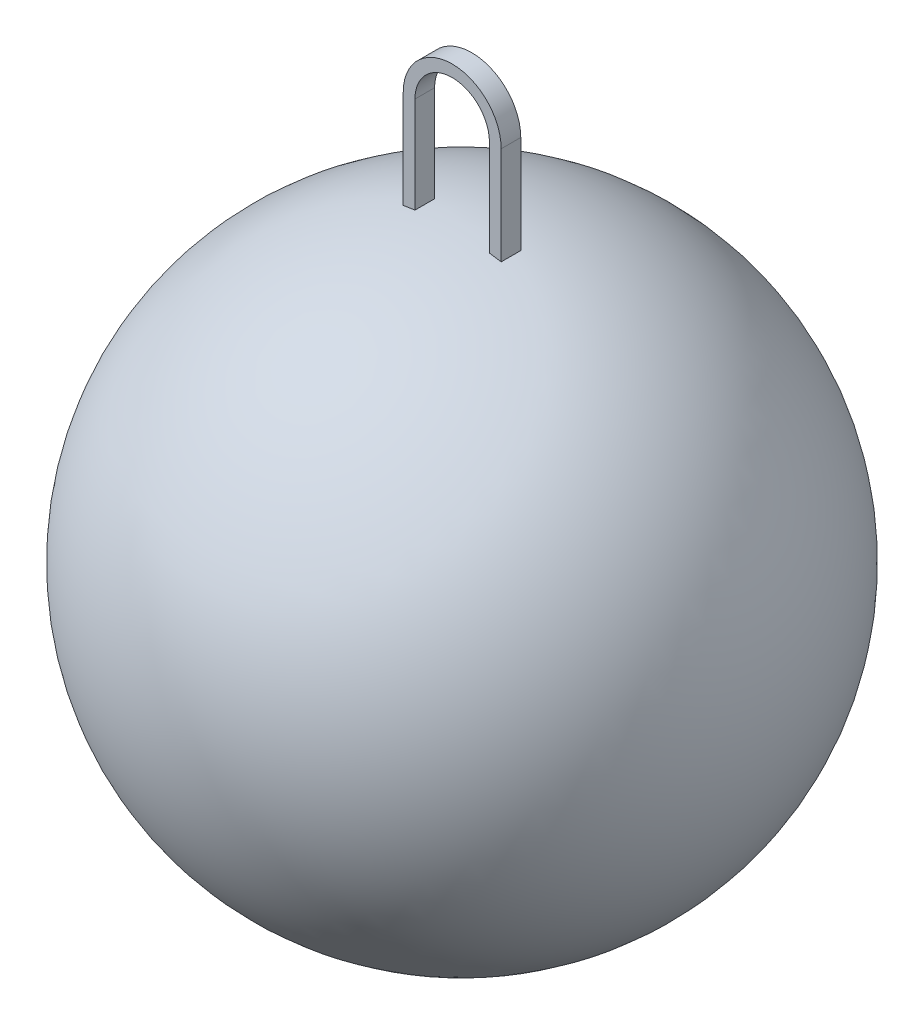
ISO-10303-21;
HEADER;
FILE_DESCRIPTION(('STEP AP214'),'2;1');
FILE_NAME('part.step','',(''),(''),'','','');
FILE_SCHEMA(('AUTOMOTIVE_DESIGN { 1 0 10303 214 1 1 1 1 }'));
ENDSEC;
DATA;
#1=APPLICATION_CONTEXT('core data for automotive mechanical design processes');
#2=APPLICATION_PROTOCOL_DEFINITION('international standard','automotive_design',2000,#1);
#3=PRODUCT_CONTEXT('',#1,'mechanical');
#4=PRODUCT('Part','Part','',(#3));
#5=PRODUCT_RELATED_PRODUCT_CATEGORY('part','',(#4));
#6=PRODUCT_DEFINITION_FORMATION('','',#4);
#7=PRODUCT_DEFINITION_CONTEXT('part definition',#1,'design');
#8=PRODUCT_DEFINITION('design','',#6,#7);
#9=PRODUCT_DEFINITION_SHAPE('','',#8);
#10=(LENGTH_UNIT() NAMED_UNIT(*) SI_UNIT(.MILLI.,.METRE.));
#11=(NAMED_UNIT(*) PLANE_ANGLE_UNIT() SI_UNIT($,.RADIAN.));
#12=(NAMED_UNIT(*) SI_UNIT($,.STERADIAN.) SOLID_ANGLE_UNIT());
#13=UNCERTAINTY_MEASURE_WITH_UNIT(LENGTH_MEASURE(1.E-05),#10,'distance_accuracy_value','');
#14=(GEOMETRIC_REPRESENTATION_CONTEXT(3) GLOBAL_UNCERTAINTY_ASSIGNED_CONTEXT((#13)) GLOBAL_UNIT_ASSIGNED_CONTEXT((#10,
#11,#12)) REPRESENTATION_CONTEXT('',''));
#15=CARTESIAN_POINT('',(0.,0.,0.));
#16=DIRECTION('',(0.,0.,1.));
#17=DIRECTION('',(1.,0.,0.));
#18=AXIS2_PLACEMENT_3D('',#15,#16,#17);
#19=CARTESIAN_POINT('',(-3.175,18.7835533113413,0.635));
#20=CARTESIAN_POINT('',(-2.92133611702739,18.8230332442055,0.635));
#21=CARTESIAN_POINT('',(-2.66767223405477,18.8625131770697,0.635));
#22=CARTESIAN_POINT('',(-2.413,18.8965587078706,0.635));
#23=B_SPLINE_CURVE_WITH_KNOTS('',3,(#19,#20,#21,#22),.UNSPECIFIED.,.F.,.F.,(4,4),(0.,
0.120994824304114),.UNSPECIFIED.);
#24=DIRECTION('',(0.,0.,-1.));
#25=VECTOR('',#24,1.);
#26=SURFACE_OF_LINEAR_EXTRUSION('',#23,#25);
#27=CARTESIAN_POINT('',(-2.41300000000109,18.8965587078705,0.));
#28=CARTESIAN_POINT('',(-2.41300225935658,18.8965584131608,0.00758621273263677));
#29=CARTESIAN_POINT('',(-2.41377594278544,18.8964550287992,0.015180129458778));
#30=CARTESIAN_POINT('',(-2.41674835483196,18.8960572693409,0.0300880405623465));
#31=CARTESIAN_POINT('',(-2.41895191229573,18.8957622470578,0.0374009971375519));
#32=CARTESIAN_POINT('',(-2.4252752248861,18.8949137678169,0.0535623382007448));
#33=CARTESIAN_POINT('',(-2.42976016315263,18.8943108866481,0.0622619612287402));
#34=CARTESIAN_POINT('',(-2.44000444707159,18.8929287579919,0.0788503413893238));
#35=CARTESIAN_POINT('',(-2.44576673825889,18.8921491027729,0.0867371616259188));
#36=CARTESIAN_POINT('',(-2.46336550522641,18.8897580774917,0.108142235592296));
#37=CARTESIAN_POINT('',(-2.47622273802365,18.8880002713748,0.120792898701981));
#38=CARTESIAN_POINT('',(-2.50349402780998,18.8842406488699,0.144229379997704));
#39=CARTESIAN_POINT('',(-2.51791298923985,18.8822380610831,0.155009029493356));
#40=CARTESIAN_POINT('',(-2.54704810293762,18.8781586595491,0.174550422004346));
#41=CARTESIAN_POINT('',(-2.56171771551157,18.8760898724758,0.183383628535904));
#42=CARTESIAN_POINT('',(-2.59172813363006,18.8718263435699,0.199783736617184));
#43=CARTESIAN_POINT('',(-2.60706925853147,18.8696315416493,0.207350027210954));
#44=CARTESIAN_POINT('',(-2.6539001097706,18.8628845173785,0.228226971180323));
#45=CARTESIAN_POINT('',(-2.68620541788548,18.8581685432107,0.239720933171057));
#46=CARTESIAN_POINT('',(-2.74672473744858,18.8492270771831,0.255876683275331));
#47=CARTESIAN_POINT('',(-2.7747312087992,18.8450495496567,0.261354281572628));
#48=CARTESIAN_POINT('',(-2.83128094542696,18.8365454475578,0.267820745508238));
#49=CARTESIAN_POINT('',(-2.85982372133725,18.8322190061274,0.268813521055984));
#50=CARTESIAN_POINT('',(-2.90785295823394,18.8248941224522,0.265801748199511));
#51=CARTESIAN_POINT('',(-2.92742813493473,18.8218959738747,0.263238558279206));
#52=CARTESIAN_POINT('',(-2.96592898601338,18.815980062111,0.255056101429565));
#53=CARTESIAN_POINT('',(-2.98485607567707,18.8130621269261,0.249444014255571));
#54=CARTESIAN_POINT('',(-3.01817095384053,18.807914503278,0.236144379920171));
#55=CARTESIAN_POINT('',(-3.03276930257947,18.8056543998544,0.228999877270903));
#56=CARTESIAN_POINT('',(-3.06058098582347,18.8013432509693,0.212372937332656));
#57=CARTESIAN_POINT('',(-3.07379708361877,18.7992917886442,0.202895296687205));
#58=CARTESIAN_POINT('',(-3.09843237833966,18.7954650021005,0.181611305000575));
#59=CARTESIAN_POINT('',(-3.10983796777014,18.7936917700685,0.169788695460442));
#60=CARTESIAN_POINT('',(-3.13021750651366,18.7905222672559,0.144158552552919));
#61=CARTESIAN_POINT('',(-3.13919233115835,18.7891258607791,0.130351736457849));
#62=CARTESIAN_POINT('',(-3.15345363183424,18.7869066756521,0.102862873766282));
#63=CARTESIAN_POINT('',(-3.15904072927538,18.7860371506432,0.0893402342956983));
#64=CARTESIAN_POINT('',(-3.16780015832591,18.7846738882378,0.0615120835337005));
#65=CARTESIAN_POINT('',(-3.17096971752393,18.7841805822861,0.0472056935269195));
#66=CARTESIAN_POINT('',(-3.17649005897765,18.7833213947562,0.00496288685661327));
#67=CARTESIAN_POINT('',(-3.17545919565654,18.7834818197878,-0.0235073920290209));
#68=CARTESIAN_POINT('',(-3.16412226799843,18.7852463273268,-0.0783368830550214));
#69=CARTESIAN_POINT('',(-3.15384571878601,18.7868458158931,-0.104702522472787));
#70=CARTESIAN_POINT('',(-3.12529474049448,18.7912881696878,-0.152671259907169));
#71=CARTESIAN_POINT('',(-3.10698395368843,18.7941366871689,-0.174252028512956));
#72=CARTESIAN_POINT('',(-3.06391971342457,18.8008260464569,-0.211398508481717));
#73=CARTESIAN_POINT('',(-3.03893356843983,18.8047026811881,-0.226682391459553));
#74=CARTESIAN_POINT('',(-2.99404481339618,18.8116439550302,-0.246300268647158));
#75=CARTESIAN_POINT('',(-2.974899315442,18.8145981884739,-0.252549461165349));
#76=CARTESIAN_POINT('',(-2.93584093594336,18.8206055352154,-0.261834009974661));
#77=CARTESIAN_POINT('',(-2.91592688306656,18.8236587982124,-0.264864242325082));
#78=CARTESIAN_POINT('',(-2.86794595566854,18.8309842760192,-0.268740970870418));
#79=CARTESIAN_POINT('',(-2.83977621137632,18.8352599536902,-0.268245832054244));
#80=CARTESIAN_POINT('',(-2.78384118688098,18.8436853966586,-0.262795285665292));
#81=CARTESIAN_POINT('',(-2.75607726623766,18.8478347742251,-0.25782734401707));
#82=CARTESIAN_POINT('',(-2.69367668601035,18.8570745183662,-0.242233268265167));
#83=CARTESIAN_POINT('',(-2.6593255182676,18.8620977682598,-0.230401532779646));
#84=CARTESIAN_POINT('',(-2.60966513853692,18.8692597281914,-0.208609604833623));
#85=CARTESIAN_POINT('',(-2.59344898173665,18.8715812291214,-0.200688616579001));
#86=CARTESIAN_POINT('',(-2.56174175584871,18.8760870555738,-0.183430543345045));
#87=CARTESIAN_POINT('',(-2.54625098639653,18.8782713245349,-0.17409287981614));
#88=CARTESIAN_POINT('',(-2.52081739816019,18.8818305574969,-0.156896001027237));
#89=CARTESIAN_POINT('',(-2.51060895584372,18.8832511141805,-0.149438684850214));
#90=CARTESIAN_POINT('',(-2.49088952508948,18.8859807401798,-0.133648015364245));
#91=CARTESIAN_POINT('',(-2.4813775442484,18.8872899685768,-0.12531595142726));
#92=CARTESIAN_POINT('',(-2.46323010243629,18.889775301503,-0.107481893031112));
#93=CARTESIAN_POINT('',(-2.45460803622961,18.8909493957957,-0.0979657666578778));
#94=CARTESIAN_POINT('',(-2.43902204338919,18.8930624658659,-0.0776255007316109));
#95=CARTESIAN_POINT('',(-2.43205117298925,18.8940024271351,-0.0668071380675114));
#96=CARTESIAN_POINT('',(-2.42336849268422,18.8951698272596,-0.0489186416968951));
#97=CARTESIAN_POINT('',(-2.42069769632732,18.895528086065,-0.0423283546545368));
#98=CARTESIAN_POINT('',(-2.4164637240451,18.8960954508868,-0.0288041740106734));
#99=CARTESIAN_POINT('',(-2.41489682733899,18.8963050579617,-0.0218715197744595));
#100=CARTESIAN_POINT('',(-2.41332785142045,18.8965148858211,-0.00993238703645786));
#101=CARTESIAN_POINT('',(-2.41299852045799,18.8965589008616,-0.00496784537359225));
#102=CARTESIAN_POINT('',(-2.41300000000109,18.8965587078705,0.));
#103=B_SPLINE_CURVE_WITH_KNOTS('',3,(#27,#28,#29,#30,#31,#32,#33,#34,#35,#36,#37,#38,#39,#40,
#41,#42,#43,#44,#45,#46,#47,#48,#49,#50,#51,#52,#53,#54,#55,#56,#57,#58,#59,#60,#61,#62,#63,#64,
#65,#66,#67,#68,#69,#70,#71,#72,#73,#74,#75,#76,#77,#78,#79,#80,#81,#82,#83,#84,#85,#86,#87,#88,
#89,#90,#91,#92,#93,#94,#95,#96,#97,#98,#99,#100,#101,#102),.UNSPECIFIED.,.T.,.F.,(4,2,2,2,2,2,
2,2,2,2,2,2,2,2,2,2,2,2,2,2,2,2,2,2,2,2,2,2,2,2,2,2,2,2,2,2,2,4),(0.,0.0227360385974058,
0.0455492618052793,0.0747975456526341,0.104113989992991,0.158182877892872,0.212426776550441,
0.264097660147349,0.315793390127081,0.419156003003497,0.505415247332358,0.591599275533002,
0.651310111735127,0.710880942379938,0.759909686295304,0.808838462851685,0.858119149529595,
0.907382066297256,0.951124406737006,0.994916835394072,1.07863906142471,1.16209496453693,
1.24593249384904,1.33319587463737,1.39398836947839,1.45487748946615,1.53990109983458,
1.6251637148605,1.73462195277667,1.78916416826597,1.84372871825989,1.88185735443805,
1.91993055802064,1.95851197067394,1.99692813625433,2.01821322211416,2.0394262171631,
2.05431495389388),.UNSPECIFIED.);
#104=CARTESIAN_POINT('',(-2.413,18.8965587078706,0.));
#105=VERTEX_POINT('',#104);
#106=CARTESIAN_POINT('',(-3.175,18.7835533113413,0.));
#107=VERTEX_POINT('',#106);
#108=EDGE_CURVE('E11',#105,#107,#103,.T.);
#109=ORIENTED_EDGE('',*,*,#108,.F.);
#110=DIRECTION('',(0.,0.,-1.));
#111=VECTOR('',#110,1.);
#112=CARTESIAN_POINT('',(-2.413,18.8965587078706,0.635));
#113=LINE('',#112,#111);
#114=CARTESIAN_POINT('',(-2.413,18.8965587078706,0.635));
#115=VERTEX_POINT('',#114);
#116=EDGE_CURVE('E54',#115,#105,#113,.T.);
#117=ORIENTED_EDGE('',*,*,#116,.F.);
#118=CARTESIAN_POINT('',(-3.175,18.7835533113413,0.635));
#119=VERTEX_POINT('',#118);
#120=EDGE_CURVE('E164',#119,#115,#23,.T.);
#121=ORIENTED_EDGE('',*,*,#120,.F.);
#122=DIRECTION('',(0.,0.,-1.));
#123=VECTOR('',#122,1.);
#124=CARTESIAN_POINT('',(-3.175,18.7835533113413,0.635));
#125=LINE('',#124,#123);
#126=EDGE_CURVE('E214',#119,#107,#125,.T.);
#127=ORIENTED_EDGE('',*,*,#126,.T.);
#128=EDGE_LOOP('',(#109,#117,#121,#127));
#129=FACE_BOUND('',#128,.T.);
#130=ADVANCED_FACE('F36',(#129),#26,.F.);
#131=CARTESIAN_POINT('',(2.413,18.8965587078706,0.635));
#132=CARTESIAN_POINT('',(2.66767223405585,18.8625131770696,0.635));
#133=CARTESIAN_POINT('',(2.92133611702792,18.8230332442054,0.635));
#134=CARTESIAN_POINT('',(3.175,18.7835533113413,0.635));
#135=B_SPLINE_CURVE_WITH_KNOTS('',3,(#131,#132,#133,#134),.UNSPECIFIED.,.F.,.F.,(4,4),
(0.879005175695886,1.),.UNSPECIFIED.);
#136=DIRECTION('',(0.,0.,-1.));
#137=VECTOR('',#136,1.);
#138=SURFACE_OF_LINEAR_EXTRUSION('',#135,#137);
#139=CARTESIAN_POINT('',(3.175,18.7835533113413,0.));
#140=CARTESIAN_POINT('',(3.17500042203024,18.7835532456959,0.0142311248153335));
#141=CARTESIAN_POINT('',(3.17378982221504,18.7837416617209,0.028458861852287));
#142=CARTESIAN_POINT('',(3.16898438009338,18.7844895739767,0.0564954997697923));
#143=CARTESIAN_POINT('',(3.16538986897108,18.7850490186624,0.0703044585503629));
#144=CARTESIAN_POINT('',(3.15592886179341,18.7865214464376,0.0970941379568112));
#145=CARTESIAN_POINT('',(3.15006314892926,18.7874343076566,0.110075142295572));
#146=CARTESIAN_POINT('',(3.13625243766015,18.7895832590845,0.134847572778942));
#147=CARTESIAN_POINT('',(3.12830742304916,18.7908193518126,0.146638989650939));
#148=CARTESIAN_POINT('',(3.11064957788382,18.7935655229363,0.168684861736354));
#149=CARTESIAN_POINT('',(3.100944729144,18.7950743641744,0.178945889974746));
#150=CARTESIAN_POINT('',(3.08005686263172,18.7983196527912,0.197810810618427));
#151=CARTESIAN_POINT('',(3.06887178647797,18.8000564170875,0.206412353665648));
#152=CARTESIAN_POINT('',(3.04456738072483,18.8038262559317,0.22238871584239));
#153=CARTESIAN_POINT('',(3.03136787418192,18.8058715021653,0.229638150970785));
#154=CARTESIAN_POINT('',(3.00406835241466,18.8100947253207,0.24216089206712));
#155=CARTESIAN_POINT('',(2.98996652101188,18.8122729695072,0.24743005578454));
#156=CARTESIAN_POINT('',(2.93273778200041,18.8210929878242,0.264646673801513));
#157=CARTESIAN_POINT('',(2.88736237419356,18.8280428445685,0.26919360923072));
#158=CARTESIAN_POINT('',(2.81053281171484,18.8396785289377,0.266442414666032));
#159=CARTESIAN_POINT('',(2.77880471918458,18.8444439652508,0.262156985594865));
#160=CARTESIAN_POINT('',(2.71637202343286,18.8537274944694,0.248627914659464));
#161=CARTESIAN_POINT('',(2.68566723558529,18.8582456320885,0.23938517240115));
#162=CARTESIAN_POINT('',(2.62477326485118,18.8670999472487,0.216162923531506));
#163=CARTESIAN_POINT('',(2.59464239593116,18.8714237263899,0.20202493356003));
#164=CARTESIAN_POINT('',(2.55145758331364,18.8775378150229,0.177231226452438));
#165=CARTESIAN_POINT('',(2.53739176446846,18.879514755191,0.168363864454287));
#166=CARTESIAN_POINT('',(2.51020225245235,18.883309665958,0.149262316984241));
#167=CARTESIAN_POINT('',(2.49707726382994,18.885127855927,0.139030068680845));
#168=CARTESIAN_POINT('',(2.47301390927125,18.8884389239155,0.117577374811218));
#169=CARTESIAN_POINT('',(2.46199110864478,18.8899448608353,0.106454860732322));
#170=CARTESIAN_POINT('',(2.44217189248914,18.8926374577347,0.0823801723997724));
#171=CARTESIAN_POINT('',(2.43335443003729,18.8938271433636,0.069447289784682));
#172=CARTESIAN_POINT('',(2.42351929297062,18.8951495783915,0.0492488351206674));
#173=CARTESIAN_POINT('',(2.42088333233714,18.8955031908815,0.0427977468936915));
#174=CARTESIAN_POINT('',(2.41666253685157,18.8960688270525,0.0295512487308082));
#175=CARTESIAN_POINT('',(2.41507654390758,18.8962810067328,0.0227562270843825));
#176=CARTESIAN_POINT('',(2.4131410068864,18.8965398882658,0.0089310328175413));
#177=CARTESIAN_POINT('',(2.41280073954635,18.8965853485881,0.00189948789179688));
#178=CARTESIAN_POINT('',(2.41342927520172,18.896501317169,-0.0121033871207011));
#179=CARTESIAN_POINT('',(2.41439869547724,18.8963717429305,-0.0190746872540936));
#180=CARTESIAN_POINT('',(2.41948813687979,18.8956904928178,-0.0413019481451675));
#181=CARTESIAN_POINT('',(2.42603426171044,18.8948133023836,-0.0559884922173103));
#182=CARTESIAN_POINT('',(2.44102392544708,18.8927914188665,-0.0806861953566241));
#183=CARTESIAN_POINT('',(2.448946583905,18.8917188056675,-0.0910669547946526));
#184=CARTESIAN_POINT('',(2.46617585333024,18.8893728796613,-0.110632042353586));
#185=CARTESIAN_POINT('',(2.47548683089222,18.8880989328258,-0.119812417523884));
#186=CARTESIAN_POINT('',(2.49512626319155,18.8853960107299,-0.13725813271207));
#187=CARTESIAN_POINT('',(2.50546727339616,18.8839650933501,-0.145508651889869));
#188=CARTESIAN_POINT('',(2.52678928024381,18.8809971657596,-0.161117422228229));
#189=CARTESIAN_POINT('',(2.53777064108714,18.8794600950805,-0.168475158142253));
#190=CARTESIAN_POINT('',(2.57145794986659,18.8747171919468,-0.189376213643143));
#191=CARTESIAN_POINT('',(2.59488738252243,18.8713823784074,-0.201730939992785));
#192=CARTESIAN_POINT('',(2.64576214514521,18.8640610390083,-0.224780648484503));
#193=CARTESIAN_POINT('',(2.6733602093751,18.8600436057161,-0.235123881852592));
#194=CARTESIAN_POINT('',(2.72968463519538,18.8517566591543,-0.251935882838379));
#195=CARTESIAN_POINT('',(2.7584102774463,18.8474873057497,-0.258407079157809));
#196=CARTESIAN_POINT('',(2.8111958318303,18.8395731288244,-0.265990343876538));
#197=CARTESIAN_POINT('',(2.83514836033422,18.8359568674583,-0.267866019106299));
#198=CARTESIAN_POINT('',(2.88307053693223,18.8286800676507,-0.267948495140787));
#199=CARTESIAN_POINT('',(2.90704013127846,18.8250195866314,-0.26615963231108));
#200=CARTESIAN_POINT('',(2.94880544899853,18.8186141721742,-0.259141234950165));
#201=CARTESIAN_POINT('',(2.96674620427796,18.815853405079,-0.254803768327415));
#202=CARTESIAN_POINT('',(3.00169102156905,18.8104630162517,-0.243262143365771));
#203=CARTESIAN_POINT('',(3.01869698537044,18.8078331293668,-0.236064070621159));
#204=CARTESIAN_POINT('',(3.0484853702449,18.8032191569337,-0.220064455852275));
#205=CARTESIAN_POINT('',(3.06150439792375,18.8011996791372,-0.211715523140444));
#206=CARTESIAN_POINT('',(3.08596924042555,18.7974015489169,-0.192949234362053));
#207=CARTESIAN_POINT('',(3.09741819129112,18.795622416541,-0.182536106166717));
#208=CARTESIAN_POINT('',(3.11837608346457,18.7923641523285,-0.15976089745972));
#209=CARTESIAN_POINT('',(3.12787463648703,18.7908866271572,-0.147388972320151));
#210=CARTESIAN_POINT('',(3.14446511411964,18.7883054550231,-0.121081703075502));
#211=CARTESIAN_POINT('',(3.1515565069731,18.7872018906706,-0.107146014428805));
#212=CARTESIAN_POINT('',(3.16312113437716,18.7854021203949,-0.0779867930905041));
#213=CARTESIAN_POINT('',(3.16755852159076,18.7847114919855,-0.0627486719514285));
#214=CARTESIAN_POINT('',(3.1734998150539,18.783786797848,-0.0316728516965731));
#215=CARTESIAN_POINT('',(3.17499953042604,18.783553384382,-0.0158343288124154));
#216=CARTESIAN_POINT('',(3.175,18.7835533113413,0.));
#217=B_SPLINE_CURVE_WITH_KNOTS('',3,(#139,#140,#141,#142,#143,#144,#145,#146,#147,#148,#149,
#150,#151,#152,#153,#154,#155,#156,#157,#158,#159,#160,#161,#162,#163,#164,#165,#166,#167,#168,
#169,#170,#171,#172,#173,#174,#175,#176,#177,#178,#179,#180,#181,#182,#183,#184,#185,#186,#187,
#188,#189,#190,#191,#192,#193,#194,#195,#196,#197,#198,#199,#200,#201,#202,#203,#204,#205,#206,
#207,#208,#209,#210,#211,#212,#213,#214,#215,#216),.UNSPECIFIED.,.T.,.F.,(4,2,2,2,2,2,2,2,2,2,2,
2,2,2,2,2,2,2,2,2,2,2,2,2,2,2,2,2,2,2,2,2,2,2,2,2,2,2,4),(0.,0.0426352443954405,
0.0852645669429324,0.127879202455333,0.170494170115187,0.212920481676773,0.255406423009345,
0.300820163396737,0.346328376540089,0.481834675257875,0.578631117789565,0.675410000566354,
0.775671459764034,0.825849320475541,0.875956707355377,0.923017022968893,0.969609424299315,
0.990471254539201,1.01131003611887,1.03230368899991,1.05330724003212,1.10063988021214,
1.13982144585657,1.17912895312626,1.21899383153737,1.25888160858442,1.33873391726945,
1.42772459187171,1.51665938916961,1.58933100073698,1.66191666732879,1.7177041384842,
1.77337355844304,1.81996888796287,1.86646974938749,1.91321220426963,1.95996497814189,
2.00733575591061,2.05477406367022),.UNSPECIFIED.);
#218=CARTESIAN_POINT('',(3.175,18.7835533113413,0.));
#219=VERTEX_POINT('',#218);
#220=CARTESIAN_POINT('',(2.413,18.8965587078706,0.));
#221=VERTEX_POINT('',#220);
#222=EDGE_CURVE('E236',#219,#221,#217,.T.);
#223=ORIENTED_EDGE('',*,*,#222,.F.);
#224=DIRECTION('',(0.,0.,-1.));
#225=VECTOR('',#224,1.);
#226=CARTESIAN_POINT('',(3.175,18.7835533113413,0.635));
#227=LINE('',#226,#225);
#228=CARTESIAN_POINT('',(3.175,18.7835533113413,0.635));
#229=VERTEX_POINT('',#228);
#230=EDGE_CURVE('E62',#229,#219,#227,.T.);
#231=ORIENTED_EDGE('',*,*,#230,.F.);
#232=CARTESIAN_POINT('',(2.413,18.8965587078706,0.635));
#233=VERTEX_POINT('',#232);
#234=EDGE_CURVE('E197',#233,#229,#135,.T.);
#235=ORIENTED_EDGE('',*,*,#234,.F.);
#236=DIRECTION('',(0.,0.,-1.));
#237=VECTOR('',#236,1.);
#238=CARTESIAN_POINT('',(2.413,18.8965587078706,0.635));
#239=LINE('',#238,#237);
#240=EDGE_CURVE('E226',#233,#221,#239,.T.);
#241=ORIENTED_EDGE('',*,*,#240,.T.);
#242=EDGE_LOOP('',(#223,#231,#235,#241));
#243=FACE_BOUND('',#242,.T.);
#244=ADVANCED_FACE('F178',(#243),#138,.F.);
#245=EDGE_CURVE('E41',#107,#105,#103,.T.);
#246=ORIENTED_EDGE('',*,*,#245,.F.);
#247=CARTESIAN_POINT('',(-3.175,18.7835533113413,-0.635));
#248=VERTEX_POINT('',#247);
#249=EDGE_CURVE('E136',#107,#248,#125,.T.);
#250=ORIENTED_EDGE('',*,*,#249,.T.);
#251=CARTESIAN_POINT('',(-3.175,18.7835533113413,-0.635));
#252=CARTESIAN_POINT('',(-2.92133611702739,18.8230332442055,-0.635));
#253=CARTESIAN_POINT('',(-2.66767223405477,18.8625131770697,-0.635));
#254=CARTESIAN_POINT('',(-2.413,18.8965587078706,-0.635));
#255=B_SPLINE_CURVE_WITH_KNOTS('',3,(#251,#252,#253,#254),.UNSPECIFIED.,.F.,.F.,(4,4),(0.,
0.120994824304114),.UNSPECIFIED.);
#256=CARTESIAN_POINT('',(-2.413,18.8965587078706,-0.635));
#257=VERTEX_POINT('',#256);
#258=EDGE_CURVE('E130',#248,#257,#255,.T.);
#259=ORIENTED_EDGE('',*,*,#258,.T.);
#260=EDGE_CURVE('E114',#105,#257,#113,.T.);
#261=ORIENTED_EDGE('',*,*,#260,.F.);
#262=EDGE_LOOP('',(#246,#250,#259,#261));
#263=FACE_BOUND('',#262,.T.);
#264=ADVANCED_FACE('F134',(#263),#26,.F.);
#265=CARTESIAN_POINT('',(-2.413,25.1335533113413,0.635));
#266=DIRECTION('',(-1.,0.,0.));
#267=DIRECTION('',(0.,0.,1.));
#268=AXIS2_PLACEMENT_3D('',#265,#266,#267);
#269=PLANE('',#268);
#270=DIRECTION('',(0.,1.,0.));
#271=VECTOR('',#270,1.);
#272=CARTESIAN_POINT('',(-2.413,25.1335533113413,-0.635));
#273=LINE('',#272,#271);
#274=CARTESIAN_POINT('',(-2.413,25.1335533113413,-0.635));
#275=VERTEX_POINT('',#274);
#276=EDGE_CURVE('E118',#257,#275,#273,.T.);
#277=ORIENTED_EDGE('',*,*,#276,.T.);
#278=DIRECTION('',(0.,0.,-1.));
#279=VECTOR('',#278,1.);
#280=CARTESIAN_POINT('',(-2.413,25.1335533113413,0.635));
#281=LINE('',#280,#279);
#282=CARTESIAN_POINT('',(-2.413,25.1335533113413,0.635));
#283=VERTEX_POINT('',#282);
#284=EDGE_CURVE('E123',#283,#275,#281,.T.);
#285=ORIENTED_EDGE('',*,*,#284,.F.);
#286=DIRECTION('',(0.,1.,0.));
#287=VECTOR('',#286,1.);
#288=CARTESIAN_POINT('',(-2.413,18.8965587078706,0.635));
#289=LINE('',#288,#287);
#290=EDGE_CURVE('E170',#115,#283,#289,.T.);
#291=ORIENTED_EDGE('',*,*,#290,.F.);
#292=ORIENTED_EDGE('',*,*,#116,.T.);
#293=ORIENTED_EDGE('',*,*,#260,.T.);
#294=EDGE_LOOP('',(#277,#285,#291,#292,#293));
#295=FACE_BOUND('',#294,.T.);
#296=ADVANCED_FACE('F116',(#295),#269,.F.);
#297=CARTESIAN_POINT('',(0.,25.1335533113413,0.635));
#298=DIRECTION('',(0.,0.,-1.));
#299=DIRECTION('',(-1.,0.,0.));
#300=AXIS2_PLACEMENT_3D('',#297,#298,#299);
#301=CYLINDRICAL_SURFACE('',#300,2.413);
#302=CARTESIAN_POINT('',(0.,25.1335533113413,-0.635));
#303=DIRECTION('',(0.,0.,-1.));
#304=DIRECTION('',(1.,0.,0.));
#305=AXIS2_PLACEMENT_3D('',#302,#303,#304);
#306=CIRCLE('',#305,2.413);
#307=CARTESIAN_POINT('',(2.413,25.1335533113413,-0.635));
#308=VERTEX_POINT('',#307);
#309=EDGE_CURVE('E132',#275,#308,#306,.T.);
#310=ORIENTED_EDGE('',*,*,#309,.T.);
#311=DIRECTION('',(0.,0.,-1.));
#312=VECTOR('',#311,1.);
#313=CARTESIAN_POINT('',(2.413,25.1335533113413,0.635));
#314=LINE('',#313,#312);
#315=CARTESIAN_POINT('',(2.413,25.1335533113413,0.635));
#316=VERTEX_POINT('',#315);
#317=EDGE_CURVE('E229',#316,#308,#314,.T.);
#318=ORIENTED_EDGE('',*,*,#317,.F.);
#319=CARTESIAN_POINT('',(0.,25.1335533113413,0.635));
#320=DIRECTION('',(0.,0.,-1.));
#321=DIRECTION('',(1.,0.,0.));
#322=AXIS2_PLACEMENT_3D('',#319,#320,#321);
#323=CIRCLE('',#322,2.413);
#324=EDGE_CURVE('E264',#283,#316,#323,.T.);
#325=ORIENTED_EDGE('',*,*,#324,.F.);
#326=ORIENTED_EDGE('',*,*,#284,.T.);
#327=EDGE_LOOP('',(#310,#318,#325,#326));
#328=FACE_BOUND('',#327,.T.);
#329=ADVANCED_FACE('F181',(#328),#301,.F.);
#330=CARTESIAN_POINT('',(2.413,18.8965587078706,0.635));
#331=DIRECTION('',(1.,0.,0.));
#332=DIRECTION('',(0.,0.,-1.));
#333=AXIS2_PLACEMENT_3D('',#330,#331,#332);
#334=PLANE('',#333);
#335=DIRECTION('',(0.,-1.,0.));
#336=VECTOR('',#335,1.);
#337=CARTESIAN_POINT('',(2.413,18.8965587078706,-0.635));
#338=LINE('',#337,#336);
#339=CARTESIAN_POINT('',(2.413,18.8965587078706,-0.635));
#340=VERTEX_POINT('',#339);
#341=EDGE_CURVE('E146',#308,#340,#338,.T.);
#342=ORIENTED_EDGE('',*,*,#341,.T.);
#343=EDGE_CURVE('E225',#221,#340,#239,.T.);
#344=ORIENTED_EDGE('',*,*,#343,.F.);
#345=ORIENTED_EDGE('',*,*,#240,.F.);
#346=DIRECTION('',(0.,-1.,0.));
#347=VECTOR('',#346,1.);
#348=CARTESIAN_POINT('',(2.413,25.1335533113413,0.635));
#349=LINE('',#348,#347);
#350=EDGE_CURVE('E204',#316,#233,#349,.T.);
#351=ORIENTED_EDGE('',*,*,#350,.F.);
#352=ORIENTED_EDGE('',*,*,#317,.T.);
#353=EDGE_LOOP('',(#342,#344,#345,#351,#352));
#354=FACE_BOUND('',#353,.T.);
#355=ADVANCED_FACE('F184',(#354),#334,.F.);
#356=EDGE_CURVE('E232',#221,#219,#217,.T.);
#357=ORIENTED_EDGE('',*,*,#356,.F.);
#358=ORIENTED_EDGE('',*,*,#343,.T.);
#359=CARTESIAN_POINT('',(2.413,18.8965587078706,-0.635));
#360=CARTESIAN_POINT('',(2.66767223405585,18.8625131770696,-0.635));
#361=CARTESIAN_POINT('',(2.92133611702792,18.8230332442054,-0.635));
#362=CARTESIAN_POINT('',(3.175,18.7835533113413,-0.635));
#363=B_SPLINE_CURVE_WITH_KNOTS('',3,(#359,#360,#361,#362),.UNSPECIFIED.,.F.,.F.,(4,4),
(0.879005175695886,1.),.UNSPECIFIED.);
#364=CARTESIAN_POINT('',(3.175,18.7835533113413,-0.635));
#365=VERTEX_POINT('',#364);
#366=EDGE_CURVE('E149',#340,#365,#363,.T.);
#367=ORIENTED_EDGE('',*,*,#366,.T.);
#368=EDGE_CURVE('E223',#219,#365,#227,.T.);
#369=ORIENTED_EDGE('',*,*,#368,.F.);
#370=EDGE_LOOP('',(#357,#358,#367,#369));
#371=FACE_BOUND('',#370,.T.);
#372=ADVANCED_FACE('F188',(#371),#138,.F.);
#373=CARTESIAN_POINT('',(3.175,25.1335533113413,0.635));
#374=DIRECTION('',(-1.,0.,0.));
#375=DIRECTION('',(0.,-1.,0.));
#376=AXIS2_PLACEMENT_3D('',#373,#374,#375);
#377=PLANE('',#376);
#378=DIRECTION('',(0.,1.,0.));
#379=VECTOR('',#378,1.);
#380=CARTESIAN_POINT('',(3.175,25.1335533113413,-0.635));
#381=LINE('',#380,#379);
#382=CARTESIAN_POINT('',(3.175,25.1335533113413,-0.635));
#383=VERTEX_POINT('',#382);
#384=EDGE_CURVE('E154',#365,#383,#381,.T.);
#385=ORIENTED_EDGE('',*,*,#384,.T.);
#386=DIRECTION('',(0.,0.,-1.));
#387=VECTOR('',#386,1.);
#388=CARTESIAN_POINT('',(3.175,25.1335533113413,0.635));
#389=LINE('',#388,#387);
#390=CARTESIAN_POINT('',(3.175,25.1335533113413,0.635));
#391=VERTEX_POINT('',#390);
#392=EDGE_CURVE('E220',#391,#383,#389,.T.);
#393=ORIENTED_EDGE('',*,*,#392,.F.);
#394=DIRECTION('',(0.,1.,0.));
#395=VECTOR('',#394,1.);
#396=CARTESIAN_POINT('',(3.175,25.1335533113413,0.635));
#397=LINE('',#396,#395);
#398=EDGE_CURVE('E203',#229,#391,#397,.T.);
#399=ORIENTED_EDGE('',*,*,#398,.F.);
#400=ORIENTED_EDGE('',*,*,#230,.T.);
#401=ORIENTED_EDGE('',*,*,#368,.T.);
#402=EDGE_LOOP('',(#385,#393,#399,#400,#401));
#403=FACE_BOUND('',#402,.T.);
#404=ADVANCED_FACE('F194',(#403),#377,.F.);
#405=CARTESIAN_POINT('',(0.,25.1335533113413,0.635));
#406=DIRECTION('',(0.,0.,-1.));
#407=DIRECTION('',(-1.,0.,0.));
#408=AXIS2_PLACEMENT_3D('',#405,#406,#407);
#409=CYLINDRICAL_SURFACE('',#408,3.175);
#410=CARTESIAN_POINT('',(0.,25.1335533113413,-0.635));
#411=DIRECTION('',(0.,0.,1.));
#412=DIRECTION('',(1.,0.,0.));
#413=AXIS2_PLACEMENT_3D('',#410,#411,#412);
#414=CIRCLE('',#413,3.175);
#415=CARTESIAN_POINT('',(-3.175,25.1335533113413,-0.635));
#416=VERTEX_POINT('',#415);
#417=EDGE_CURVE('E159',#383,#416,#414,.T.);
#418=ORIENTED_EDGE('',*,*,#417,.T.);
#419=DIRECTION('',(0.,0.,-1.));
#420=VECTOR('',#419,1.);
#421=CARTESIAN_POINT('',(-3.175,25.1335533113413,0.635));
#422=LINE('',#421,#420);
#423=CARTESIAN_POINT('',(-3.175,25.1335533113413,0.635));
#424=VERTEX_POINT('',#423);
#425=EDGE_CURVE('E217',#424,#416,#422,.T.);
#426=ORIENTED_EDGE('',*,*,#425,.F.);
#427=CARTESIAN_POINT('',(0.,25.1335533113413,0.635));
#428=DIRECTION('',(0.,0.,1.));
#429=DIRECTION('',(1.,0.,0.));
#430=AXIS2_PLACEMENT_3D('',#427,#428,#429);
#431=CIRCLE('',#430,3.175);
#432=EDGE_CURVE('E209',#391,#424,#431,.T.);
#433=ORIENTED_EDGE('',*,*,#432,.F.);
#434=ORIENTED_EDGE('',*,*,#392,.T.);
#435=EDGE_LOOP('',(#418,#426,#433,#434));
#436=FACE_BOUND('',#435,.T.);
#437=ADVANCED_FACE('F256',(#436),#409,.T.);
#438=CARTESIAN_POINT('',(-3.175,25.1335533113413,0.635));
#439=DIRECTION('',(1.,0.,0.));
#440=DIRECTION('',(0.,1.,0.));
#441=AXIS2_PLACEMENT_3D('',#438,#439,#440);
#442=PLANE('',#441);
#443=DIRECTION('',(0.,-1.,0.));
#444=VECTOR('',#443,1.);
#445=CARTESIAN_POINT('',(-3.175,25.1335533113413,-0.635));
#446=LINE('',#445,#444);
#447=EDGE_CURVE('E162',#416,#248,#446,.T.);
#448=ORIENTED_EDGE('',*,*,#447,.T.);
#449=ORIENTED_EDGE('',*,*,#249,.F.);
#450=ORIENTED_EDGE('',*,*,#126,.F.);
#451=DIRECTION('',(0.,-1.,0.));
#452=VECTOR('',#451,1.);
#453=CARTESIAN_POINT('',(-3.175,25.1335533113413,0.635));
#454=LINE('',#453,#452);
#455=EDGE_CURVE('E212',#424,#119,#454,.T.);
#456=ORIENTED_EDGE('',*,*,#455,.F.);
#457=ORIENTED_EDGE('',*,*,#425,.T.);
#458=EDGE_LOOP('',(#448,#449,#450,#456,#457));
#459=FACE_BOUND('',#458,.T.);
#460=ADVANCED_FACE('F244',(#459),#442,.F.);
#461=CARTESIAN_POINT('',(-2.79437813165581,18.8420939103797,0.635));
#462=DIRECTION('',(0.,0.,1.));
#463=DIRECTION('',(1.,0.,0.));
#464=AXIS2_PLACEMENT_3D('',#461,#462,#463);
#465=PLANE('',#464);
#466=ORIENTED_EDGE('',*,*,#120,.T.);
#467=ORIENTED_EDGE('',*,*,#290,.T.);
#468=ORIENTED_EDGE('',*,*,#324,.T.);
#469=ORIENTED_EDGE('',*,*,#350,.T.);
#470=ORIENTED_EDGE('',*,*,#234,.T.);
#471=ORIENTED_EDGE('',*,*,#398,.T.);
#472=ORIENTED_EDGE('',*,*,#432,.T.);
#473=ORIENTED_EDGE('',*,*,#455,.T.);
#474=EDGE_LOOP('',(#466,#467,#468,#469,#470,#471,#472,#473));
#475=FACE_BOUND('',#474,.T.);
#476=ADVANCED_FACE('F249',(#475),#465,.T.);
#477=CARTESIAN_POINT('',(-2.79437813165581,18.8420939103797,-0.635));
#478=DIRECTION('',(0.,0.,1.));
#479=DIRECTION('',(1.,0.,0.));
#480=AXIS2_PLACEMENT_3D('',#477,#478,#479);
#481=PLANE('',#480);
#482=ORIENTED_EDGE('',*,*,#258,.F.);
#483=ORIENTED_EDGE('',*,*,#447,.F.);
#484=ORIENTED_EDGE('',*,*,#417,.F.);
#485=ORIENTED_EDGE('',*,*,#384,.F.);
#486=ORIENTED_EDGE('',*,*,#366,.F.);
#487=ORIENTED_EDGE('',*,*,#341,.F.);
#488=ORIENTED_EDGE('',*,*,#309,.F.);
#489=ORIENTED_EDGE('',*,*,#276,.F.);
#490=EDGE_LOOP('',(#482,#483,#484,#485,#486,#487,#488,#489));
#491=FACE_BOUND('',#490,.T.);
#492=ADVANCED_FACE('F128',(#491),#481,.F.);
#493=CARTESIAN_POINT('',(0.,0.,0.));
#494=DIRECTION('',(0.,-1.,0.));
#495=DIRECTION('',(-1.,0.,0.));
#496=AXIS2_PLACEMENT_3D('',#493,#494,#495);
#497=SPHERICAL_SURFACE('',#496,19.05);
#498=ORIENTED_EDGE('',*,*,#356,.T.);
#499=ORIENTED_EDGE('',*,*,#222,.T.);
#500=EDGE_LOOP('',(#498,#499));
#501=FACE_BOUND('',#500,.T.);
#502=ORIENTED_EDGE('',*,*,#245,.T.);
#503=ORIENTED_EDGE('',*,*,#108,.T.);
#504=EDGE_LOOP('',(#502,#503));
#505=FACE_BOUND('',#504,.T.);
#506=ADVANCED_FACE('F38',(#501,#505),#497,.T.);
#507=CLOSED_SHELL('',(#130,#244,#264,#296,#329,#355,#372,#404,#437,#460,#476,#492,#506));
#508=MANIFOLD_SOLID_BREP('B2',#507);
#509=ADVANCED_BREP_SHAPE_REPRESENTATION('',(#18,#508),#14);
#510=SHAPE_DEFINITION_REPRESENTATION(#9,#509);
ENDSEC;
END-ISO-10303-21;
